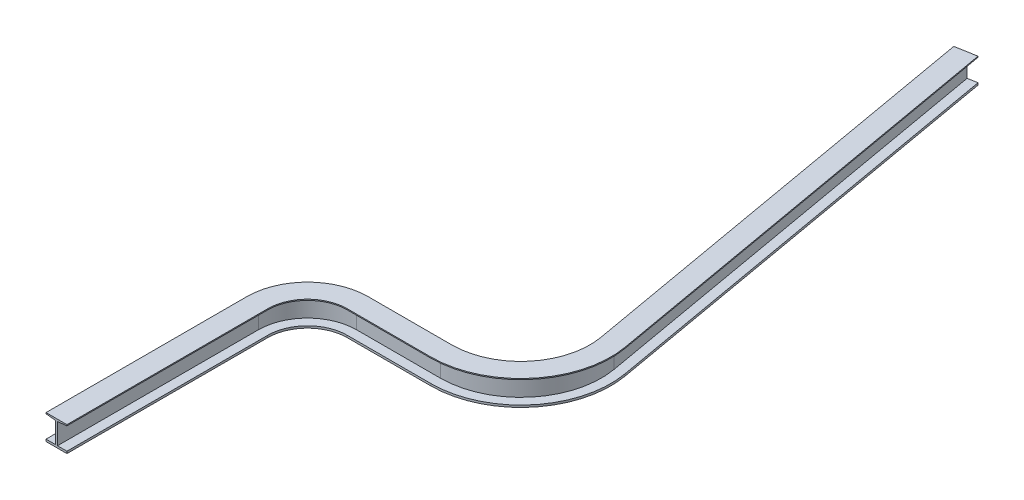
from build123d import *


with BuildPart() as part:
    # Sweep1: sweep along a path in Sketch2
    with BuildLine(Plane(origin=(0, 0, 0), x_dir=(1, 0, 0), z_dir=(0, 1, 0))) as sweep1_path:
        Line((414.679597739, 2345.93538545), (644.034110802, 1045.201305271))
        ThreePointArc((644.034110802, 1045.201305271), (591.246524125, 848.195349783), (406.4, 762))
        Line((406.4, 762), (152.4, 762))
        ThreePointArc((152.4, 762), (44.636926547, 717.363073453), (0, 609.6))
        Line((0, 609.6), (0, 0))
    # Sketch6 → Sweep1 (sweep)
    with BuildSketch(Plane.XY):
        Polygon((-31.75, 50.8), (31.75, 50.8), (31.75, 47.625), (3.175, 44.45), (3.175, -19.05), (31.75, -19.05), (31.75, -25.4), (-31.75, -25.4), (-31.75, -19.05), (-3.175, -19.05), (-3.175, 44.45), (-31.75, 47.625), align=None)
    sweep(path=sweep1_path.line)


solid = part.part
